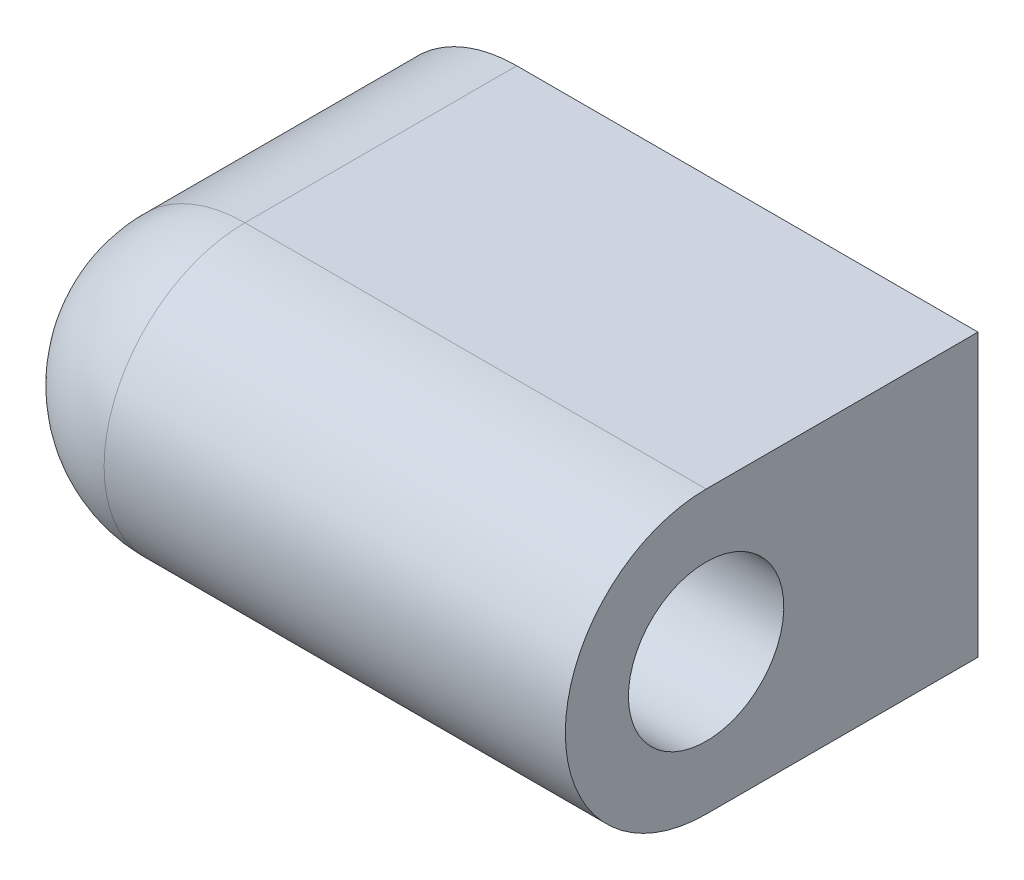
ISO-10303-21;
HEADER;
FILE_DESCRIPTION(('STEP AP214'),'2;1');
FILE_NAME('part.step','',(''),(''),'','','');
FILE_SCHEMA(('AUTOMOTIVE_DESIGN { 1 0 10303 214 1 1 1 1 }'));
ENDSEC;
DATA;
#1=APPLICATION_CONTEXT('core data for automotive mechanical design processes');
#2=APPLICATION_PROTOCOL_DEFINITION('international standard','automotive_design',2000,#1);
#3=PRODUCT_CONTEXT('',#1,'mechanical');
#4=PRODUCT('Part','Part','',(#3));
#5=PRODUCT_RELATED_PRODUCT_CATEGORY('part','',(#4));
#6=PRODUCT_DEFINITION_FORMATION('','',#4);
#7=PRODUCT_DEFINITION_CONTEXT('part definition',#1,'design');
#8=PRODUCT_DEFINITION('design','',#6,#7);
#9=PRODUCT_DEFINITION_SHAPE('','',#8);
#10=(LENGTH_UNIT() NAMED_UNIT(*) SI_UNIT(.MILLI.,.METRE.));
#11=(NAMED_UNIT(*) PLANE_ANGLE_UNIT() SI_UNIT($,.RADIAN.));
#12=(NAMED_UNIT(*) SI_UNIT($,.STERADIAN.) SOLID_ANGLE_UNIT());
#13=UNCERTAINTY_MEASURE_WITH_UNIT(LENGTH_MEASURE(1.E-05),#10,'distance_accuracy_value','');
#14=(GEOMETRIC_REPRESENTATION_CONTEXT(3) GLOBAL_UNCERTAINTY_ASSIGNED_CONTEXT((#13)) GLOBAL_UNIT_ASSIGNED_CONTEXT((#10,
#11,#12)) REPRESENTATION_CONTEXT('',''));
#15=CARTESIAN_POINT('',(0.,0.,0.));
#16=DIRECTION('',(0.,0.,1.));
#17=DIRECTION('',(1.,0.,0.));
#18=AXIS2_PLACEMENT_3D('',#15,#16,#17);
#19=CARTESIAN_POINT('',(-6.,7.25,0.));
#20=DIRECTION('',(0.,-1.,0.));
#21=DIRECTION('',(1.,0.,0.));
#22=AXIS2_PLACEMENT_3D('',#19,#20,#21);
#23=PLANE('',#22);
#24=DIRECTION('',(1.,0.,0.));
#25=VECTOR('',#24,1.);
#26=CARTESIAN_POINT('',(-6.,7.25,0.));
#27=LINE('',#26,#25);
#28=CARTESIAN_POINT('',(1.25,7.25,0.));
#29=VERTEX_POINT('',#28);
#30=CARTESIAN_POINT('',(25.,7.25,0.));
#31=VERTEX_POINT('',#30);
#32=EDGE_CURVE('E107',#29,#31,#27,.T.);
#33=ORIENTED_EDGE('',*,*,#32,.F.);
#34=DIRECTION('',(0.,0.,-1.));
#35=VECTOR('',#34,1.);
#36=CARTESIAN_POINT('',(1.25,7.25,14.));
#37=LINE('',#36,#35);
#38=CARTESIAN_POINT('',(1.25,7.25,14.));
#39=VERTEX_POINT('',#38);
#40=EDGE_CURVE('E22',#29,#39,#37,.F.);
#41=ORIENTED_EDGE('',*,*,#40,.T.);
#42=DIRECTION('',(1.,0.,0.));
#43=VECTOR('',#42,1.);
#44=CARTESIAN_POINT('',(-6.,7.25,14.));
#45=LINE('',#44,#43);
#46=CARTESIAN_POINT('',(25.,7.25,14.));
#47=VERTEX_POINT('',#46);
#48=EDGE_CURVE('E101',#39,#47,#45,.T.);
#49=ORIENTED_EDGE('',*,*,#48,.T.);
#50=DIRECTION('',(0.,0.,-1.));
#51=VECTOR('',#50,1.);
#52=CARTESIAN_POINT('',(25.,7.25,0.));
#53=LINE('',#52,#51);
#54=EDGE_CURVE('E89',#47,#31,#53,.T.);
#55=ORIENTED_EDGE('',*,*,#54,.T.);
#56=EDGE_LOOP('',(#33,#41,#49,#55));
#57=FACE_BOUND('',#56,.T.);
#58=ADVANCED_FACE('F14',(#57),#23,.F.);
#59=CARTESIAN_POINT('',(-6.,7.25,0.));
#60=DIRECTION('',(0.,0.,1.));
#61=DIRECTION('',(-1.,0.,0.));
#62=AXIS2_PLACEMENT_3D('',#59,#60,#61);
#63=PLANE('',#62);
#64=CARTESIAN_POINT('',(19.,0.,0.));
#65=DIRECTION('',(0.,0.,-1.));
#66=DIRECTION('',(1.,0.,0.));
#67=AXIS2_PLACEMENT_3D('',#64,#65,#66);
#68=CIRCLE('',#67,2.9);
#69=CARTESIAN_POINT('',(21.9,0.,0.));
#70=VERTEX_POINT('',#69);
#71=EDGE_CURVE('E79',#70,#70,#68,.T.);
#72=ORIENTED_EDGE('',*,*,#71,.F.);
#73=EDGE_LOOP('',(#72));
#74=FACE_BOUND('',#73,.T.);
#75=CARTESIAN_POINT('',(0.,0.,0.));
#76=DIRECTION('',(0.,0.,-1.));
#77=DIRECTION('',(1.,0.,0.));
#78=AXIS2_PLACEMENT_3D('',#75,#76,#77);
#79=CIRCLE('',#78,2.9);
#80=CARTESIAN_POINT('',(2.9,0.,0.));
#81=VERTEX_POINT('',#80);
#82=EDGE_CURVE('E73',#81,#81,#79,.T.);
#83=ORIENTED_EDGE('',*,*,#82,.F.);
#84=EDGE_LOOP('',(#83));
#85=FACE_BOUND('',#84,.T.);
#86=CARTESIAN_POINT('',(1.25,0.,0.));
#87=DIRECTION('',(0.,0.,1.));
#88=DIRECTION('',(-1.,0.,0.));
#89=AXIS2_PLACEMENT_3D('',#86,#87,#88);
#90=CIRCLE('',#89,7.25);
#91=CARTESIAN_POINT('',(1.25,-7.25,0.));
#92=VERTEX_POINT('',#91);
#93=CARTESIAN_POINT('',(-6.,0.,0.));
#94=VERTEX_POINT('',#93);
#95=EDGE_CURVE('E35',#92,#94,#90,.F.);
#96=ORIENTED_EDGE('',*,*,#95,.T.);
#97=CARTESIAN_POINT('',(1.25,0.,0.));
#98=DIRECTION('',(0.,0.,1.));
#99=DIRECTION('',(-1.,0.,0.));
#100=AXIS2_PLACEMENT_3D('',#97,#98,#99);
#101=CIRCLE('',#100,7.25);
#102=EDGE_CURVE('E30',#94,#29,#101,.F.);
#103=ORIENTED_EDGE('',*,*,#102,.T.);
#104=ORIENTED_EDGE('',*,*,#32,.T.);
#105=DIRECTION('',(0.,-1.,0.));
#106=VECTOR('',#105,1.);
#107=CARTESIAN_POINT('',(25.,7.25,0.));
#108=LINE('',#107,#106);
#109=CARTESIAN_POINT('',(25.,-7.25,0.));
#110=VERTEX_POINT('',#109);
#111=EDGE_CURVE('E92',#31,#110,#108,.T.);
#112=ORIENTED_EDGE('',*,*,#111,.T.);
#113=DIRECTION('',(1.,0.,0.));
#114=VECTOR('',#113,1.);
#115=CARTESIAN_POINT('',(-6.,-7.25,0.));
#116=LINE('',#115,#114);
#117=EDGE_CURVE('E105',#92,#110,#116,.T.);
#118=ORIENTED_EDGE('',*,*,#117,.F.);
#119=EDGE_LOOP('',(#96,#103,#104,#112,#118));
#120=FACE_BOUND('',#119,.T.);
#121=ADVANCED_FACE('F145',(#74,#85,#120),#63,.F.);
#122=CARTESIAN_POINT('',(-6.,-7.25,0.));
#123=DIRECTION('',(0.,1.,0.));
#124=DIRECTION('',(-1.,0.,0.));
#125=AXIS2_PLACEMENT_3D('',#122,#123,#124);
#126=PLANE('',#125);
#127=DIRECTION('',(1.,0.,0.));
#128=VECTOR('',#127,1.);
#129=CARTESIAN_POINT('',(-6.,-7.25,14.));
#130=LINE('',#129,#128);
#131=CARTESIAN_POINT('',(1.25,-7.25,14.));
#132=VERTEX_POINT('',#131);
#133=CARTESIAN_POINT('',(25.,-7.25,14.));
#134=VERTEX_POINT('',#133);
#135=EDGE_CURVE('E103',#132,#134,#130,.T.);
#136=ORIENTED_EDGE('',*,*,#135,.F.);
#137=DIRECTION('',(0.,0.,1.));
#138=VECTOR('',#137,1.);
#139=CARTESIAN_POINT('',(1.25,-7.25,0.));
#140=LINE('',#139,#138);
#141=EDGE_CURVE('E9',#132,#92,#140,.F.);
#142=ORIENTED_EDGE('',*,*,#141,.T.);
#143=ORIENTED_EDGE('',*,*,#117,.T.);
#144=DIRECTION('',(0.,0.,1.));
#145=VECTOR('',#144,1.);
#146=CARTESIAN_POINT('',(25.,-7.25,0.));
#147=LINE('',#146,#145);
#148=EDGE_CURVE('E95',#110,#134,#147,.T.);
#149=ORIENTED_EDGE('',*,*,#148,.T.);
#150=EDGE_LOOP('',(#136,#142,#143,#149));
#151=FACE_BOUND('',#150,.T.);
#152=ADVANCED_FACE('F147',(#151),#126,.F.);
#153=CARTESIAN_POINT('',(-6.,0.,14.));
#154=DIRECTION('',(1.,0.,0.));
#155=DIRECTION('',(0.,1.,0.));
#156=AXIS2_PLACEMENT_3D('',#153,#154,#155);
#157=CYLINDRICAL_SURFACE('',#156,7.25);
#158=ORIENTED_EDGE('',*,*,#48,.F.);
#159=CARTESIAN_POINT('',(1.25,0.,14.));
#160=DIRECTION('',(1.,0.,0.));
#161=DIRECTION('',(0.,1.,0.));
#162=AXIS2_PLACEMENT_3D('',#159,#160,#161);
#163=CIRCLE('',#162,7.25);
#164=EDGE_CURVE('E109',#39,#132,#163,.T.);
#165=ORIENTED_EDGE('',*,*,#164,.T.);
#166=ORIENTED_EDGE('',*,*,#135,.T.);
#167=CARTESIAN_POINT('',(25.,0.,14.));
#168=DIRECTION('',(-1.,0.,0.));
#169=DIRECTION('',(0.,-1.,0.));
#170=AXIS2_PLACEMENT_3D('',#167,#168,#169);
#171=CIRCLE('',#170,7.25);
#172=EDGE_CURVE('E98',#134,#47,#171,.T.);
#173=ORIENTED_EDGE('',*,*,#172,.T.);
#174=EDGE_LOOP('',(#158,#165,#166,#173));
#175=FACE_BOUND('',#174,.T.);
#176=ADVANCED_FACE('F155',(#175),#157,.T.);
#177=CARTESIAN_POINT('',(25.,0.,14.));
#178=DIRECTION('',(-1.,0.,0.));
#179=DIRECTION('',(0.,-1.,0.));
#180=AXIS2_PLACEMENT_3D('',#177,#178,#179);
#181=PLANE('',#180);
#182=CARTESIAN_POINT('',(25.,0.,14.));
#183=DIRECTION('',(1.,0.,0.));
#184=DIRECTION('',(0.,1.,0.));
#185=AXIS2_PLACEMENT_3D('',#182,#183,#184);
#186=CIRCLE('',#185,4.);
#187=CARTESIAN_POINT('',(25.,4.,14.));
#188=VERTEX_POINT('',#187);
#189=EDGE_CURVE('E72',#188,#188,#186,.T.);
#190=ORIENTED_EDGE('',*,*,#189,.F.);
#191=EDGE_LOOP('',(#190));
#192=FACE_BOUND('',#191,.T.);
#193=ORIENTED_EDGE('',*,*,#54,.F.);
#194=ORIENTED_EDGE('',*,*,#172,.F.);
#195=ORIENTED_EDGE('',*,*,#148,.F.);
#196=ORIENTED_EDGE('',*,*,#111,.F.);
#197=EDGE_LOOP('',(#193,#194,#195,#196));
#198=FACE_BOUND('',#197,.T.);
#199=ADVANCED_FACE('F163',(#192,#198),#181,.F.);
#200=CARTESIAN_POINT('',(1.25,0.,14.));
#201=DIRECTION('',(0.,0.,-1.));
#202=DIRECTION('',(1.,0.,0.));
#203=AXIS2_PLACEMENT_3D('',#200,#201,#202);
#204=CYLINDRICAL_SURFACE('',#203,7.25);
#205=DIRECTION('',(0.,0.,1.));
#206=VECTOR('',#205,1.);
#207=CARTESIAN_POINT('',(-6.,0.,14.));
#208=LINE('',#207,#206);
#209=CARTESIAN_POINT('',(-6.,0.,14.));
#210=VERTEX_POINT('',#209);
#211=EDGE_CURVE('E87',#94,#210,#208,.T.);
#212=ORIENTED_EDGE('',*,*,#211,.F.);
#213=ORIENTED_EDGE('',*,*,#95,.F.);
#214=ORIENTED_EDGE('',*,*,#141,.F.);
#215=CARTESIAN_POINT('',(1.25,0.,14.));
#216=DIRECTION('',(0.,0.,1.));
#217=DIRECTION('',(-1.,0.,0.));
#218=AXIS2_PLACEMENT_3D('',#215,#216,#217);
#219=CIRCLE('',#218,7.25);
#220=EDGE_CURVE('E85',#210,#132,#219,.T.);
#221=ORIENTED_EDGE('',*,*,#220,.F.);
#222=EDGE_LOOP('',(#212,#213,#214,#221));
#223=FACE_BOUND('',#222,.T.);
#224=ADVANCED_FACE('F167',(#223),#204,.T.);
#225=CARTESIAN_POINT('',(1.25,0.,14.));
#226=DIRECTION('',(0.,0.,1.));
#227=DIRECTION('',(-1.,0.,0.));
#228=AXIS2_PLACEMENT_3D('',#225,#226,#227);
#229=CYLINDRICAL_SURFACE('',#228,7.25);
#230=ORIENTED_EDGE('',*,*,#102,.F.);
#231=ORIENTED_EDGE('',*,*,#211,.T.);
#232=CARTESIAN_POINT('',(1.25,0.,14.));
#233=DIRECTION('',(0.,0.,1.));
#234=DIRECTION('',(-1.,0.,0.));
#235=AXIS2_PLACEMENT_3D('',#232,#233,#234);
#236=CIRCLE('',#235,7.25);
#237=EDGE_CURVE('E76',#39,#210,#236,.T.);
#238=ORIENTED_EDGE('',*,*,#237,.F.);
#239=ORIENTED_EDGE('',*,*,#40,.F.);
#240=EDGE_LOOP('',(#230,#231,#238,#239));
#241=FACE_BOUND('',#240,.T.);
#242=ADVANCED_FACE('F171',(#241),#229,.T.);
#243=CARTESIAN_POINT('',(1.25,0.,14.));
#244=DIRECTION('',(-1.,0.,0.));
#245=DIRECTION('',(0.,-1.,0.));
#246=AXIS2_PLACEMENT_3D('',#243,#244,#245);
#247=SPHERICAL_SURFACE('',#246,7.25);
#248=ORIENTED_EDGE('',*,*,#220,.T.);
#249=ORIENTED_EDGE('',*,*,#164,.F.);
#250=ORIENTED_EDGE('',*,*,#237,.T.);
#251=EDGE_LOOP('',(#248,#249,#250));
#252=FACE_BOUND('',#251,.T.);
#253=ADVANCED_FACE('F175',(#252),#247,.T.);
#254=CARTESIAN_POINT('',(25.,0.,14.));
#255=DIRECTION('',(1.,0.,0.));
#256=DIRECTION('',(0.,1.,0.));
#257=AXIS2_PLACEMENT_3D('',#254,#255,#256);
#258=CYLINDRICAL_SURFACE('',#257,4.);
#259=CARTESIAN_POINT('',(0.,0.,14.));
#260=DIRECTION('',(1.,0.,0.));
#261=DIRECTION('',(0.,1.,0.));
#262=AXIS2_PLACEMENT_3D('',#259,#260,#261);
#263=CIRCLE('',#262,4.);
#264=CARTESIAN_POINT('',(0.,4.,14.));
#265=VERTEX_POINT('',#264);
#266=EDGE_CURVE('E70',#265,#265,#263,.T.);
#267=ORIENTED_EDGE('',*,*,#266,.F.);
#268=EDGE_LOOP('',(#267));
#269=FACE_BOUND('',#268,.T.);
#270=ORIENTED_EDGE('',*,*,#189,.T.);
#271=EDGE_LOOP('',(#270));
#272=FACE_BOUND('',#271,.T.);
#273=ADVANCED_FACE('F66',(#269,#272),#258,.F.);
#274=CARTESIAN_POINT('',(0.,0.,14.));
#275=DIRECTION('',(1.,0.,0.));
#276=DIRECTION('',(0.,1.,0.));
#277=AXIS2_PLACEMENT_3D('',#274,#275,#276);
#278=CONICAL_SURFACE('',#277,4.,1.02974425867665);
#279=CARTESIAN_POINT('',(-2.40344247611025,0.,14.));
#280=VERTEX_POINT('',#279);
#281=VERTEX_LOOP('',#280);
#282=FACE_BOUND('',#281,.T.);
#283=ORIENTED_EDGE('',*,*,#266,.T.);
#284=EDGE_LOOP('',(#283));
#285=FACE_BOUND('',#284,.T.);
#286=ADVANCED_FACE('F62',(#282,#285),#278,.F.);
#287=CARTESIAN_POINT('',(0.,0.,0.));
#288=DIRECTION('',(0.,0.,-1.));
#289=DIRECTION('',(1.,0.,0.));
#290=AXIS2_PLACEMENT_3D('',#287,#288,#289);
#291=CONICAL_SURFACE('',#290,2.9,0.785398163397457);
#292=CARTESIAN_POINT('',(0.,0.,0.4));
#293=DIRECTION('',(0.,0.,-1.));
#294=DIRECTION('',(1.,0.,0.));
#295=AXIS2_PLACEMENT_3D('',#292,#293,#294);
#296=CIRCLE('',#295,2.5);
#297=CARTESIAN_POINT('',(2.5,0.,0.4));
#298=VERTEX_POINT('',#297);
#299=EDGE_CURVE('E17',#298,#298,#296,.F.);
#300=ORIENTED_EDGE('',*,*,#299,.T.);
#301=EDGE_LOOP('',(#300));
#302=FACE_BOUND('',#301,.T.);
#303=ORIENTED_EDGE('',*,*,#82,.T.);
#304=EDGE_LOOP('',(#303));
#305=FACE_BOUND('',#304,.T.);
#306=ADVANCED_FACE('F65',(#302,#305),#291,.F.);
#307=CARTESIAN_POINT('',(19.,0.,0.));
#308=DIRECTION('',(0.,0.,-1.));
#309=DIRECTION('',(1.,0.,0.));
#310=AXIS2_PLACEMENT_3D('',#307,#308,#309);
#311=CONICAL_SURFACE('',#310,2.9,0.785398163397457);
#312=CARTESIAN_POINT('',(19.,0.,0.4));
#313=DIRECTION('',(0.,0.,-1.));
#314=DIRECTION('',(1.,0.,0.));
#315=AXIS2_PLACEMENT_3D('',#312,#313,#314);
#316=CIRCLE('',#315,2.5);
#317=CARTESIAN_POINT('',(21.5,0.,0.4));
#318=VERTEX_POINT('',#317);
#319=EDGE_CURVE('E114',#318,#318,#316,.F.);
#320=ORIENTED_EDGE('',*,*,#319,.T.);
#321=EDGE_LOOP('',(#320));
#322=FACE_BOUND('',#321,.T.);
#323=ORIENTED_EDGE('',*,*,#71,.T.);
#324=EDGE_LOOP('',(#323));
#325=FACE_BOUND('',#324,.T.);
#326=ADVANCED_FACE('F141',(#322,#325),#311,.F.);
#327=CARTESIAN_POINT('',(19.,0.,8.));
#328=DIRECTION('',(0.,0.,-1.));
#329=DIRECTION('',(1.,0.,0.));
#330=AXIS2_PLACEMENT_3D('',#327,#328,#329);
#331=CYLINDRICAL_SURFACE('',#330,2.5);
#332=CARTESIAN_POINT('',(19.,0.,8.));
#333=DIRECTION('',(0.,0.,-1.));
#334=DIRECTION('',(1.,0.,0.));
#335=AXIS2_PLACEMENT_3D('',#332,#333,#334);
#336=CIRCLE('',#335,2.5);
#337=CARTESIAN_POINT('',(21.5,0.,8.));
#338=VERTEX_POINT('',#337);
#339=EDGE_CURVE('E116',#338,#338,#336,.T.);
#340=ORIENTED_EDGE('',*,*,#339,.F.);
#341=EDGE_LOOP('',(#340));
#342=FACE_BOUND('',#341,.T.);
#343=ORIENTED_EDGE('',*,*,#319,.F.);
#344=EDGE_LOOP('',(#343));
#345=FACE_BOUND('',#344,.T.);
#346=ADVANCED_FACE('F184',(#342,#345),#331,.F.);
#347=CARTESIAN_POINT('',(19.,0.,8.));
#348=DIRECTION('',(0.,0.,-1.));
#349=DIRECTION('',(1.,0.,0.));
#350=AXIS2_PLACEMENT_3D('',#347,#348,#349);
#351=PLANE('',#350);
#352=ORIENTED_EDGE('',*,*,#339,.T.);
#353=EDGE_LOOP('',(#352));
#354=FACE_BOUND('',#353,.T.);
#355=ADVANCED_FACE('F135',(#354),#351,.T.);
#356=CARTESIAN_POINT('',(0.,0.,8.));
#357=DIRECTION('',(0.,0.,-1.));
#358=DIRECTION('',(1.,0.,0.));
#359=AXIS2_PLACEMENT_3D('',#356,#357,#358);
#360=CYLINDRICAL_SURFACE('',#359,2.5);
#361=CARTESIAN_POINT('',(0.,0.,8.));
#362=DIRECTION('',(0.,0.,-1.));
#363=DIRECTION('',(1.,0.,0.));
#364=AXIS2_PLACEMENT_3D('',#361,#362,#363);
#365=CIRCLE('',#364,2.5);
#366=CARTESIAN_POINT('',(2.5,0.,8.));
#367=VERTEX_POINT('',#366);
#368=EDGE_CURVE('E125',#367,#367,#365,.T.);
#369=ORIENTED_EDGE('',*,*,#368,.F.);
#370=EDGE_LOOP('',(#369));
#371=FACE_BOUND('',#370,.T.);
#372=ORIENTED_EDGE('',*,*,#299,.F.);
#373=EDGE_LOOP('',(#372));
#374=FACE_BOUND('',#373,.T.);
#375=ADVANCED_FACE('F132',(#371,#374),#360,.F.);
#376=CARTESIAN_POINT('',(0.,0.,8.));
#377=DIRECTION('',(0.,0.,-1.));
#378=DIRECTION('',(1.,0.,0.));
#379=AXIS2_PLACEMENT_3D('',#376,#377,#378);
#380=PLANE('',#379);
#381=ORIENTED_EDGE('',*,*,#368,.T.);
#382=EDGE_LOOP('',(#381));
#383=FACE_BOUND('',#382,.T.);
#384=ADVANCED_FACE('F130',(#383),#380,.T.);
#385=CLOSED_SHELL('',(#58,#121,#152,#176,#199,#224,#242,#253,#273,#286,#306,#326,#346,#355,#375,#384));
#386=MANIFOLD_SOLID_BREP('B1',#385);
#387=ADVANCED_BREP_SHAPE_REPRESENTATION('',(#18,#386),#14);
#388=SHAPE_DEFINITION_REPRESENTATION(#9,#387);
ENDSEC;
END-ISO-10303-21;
